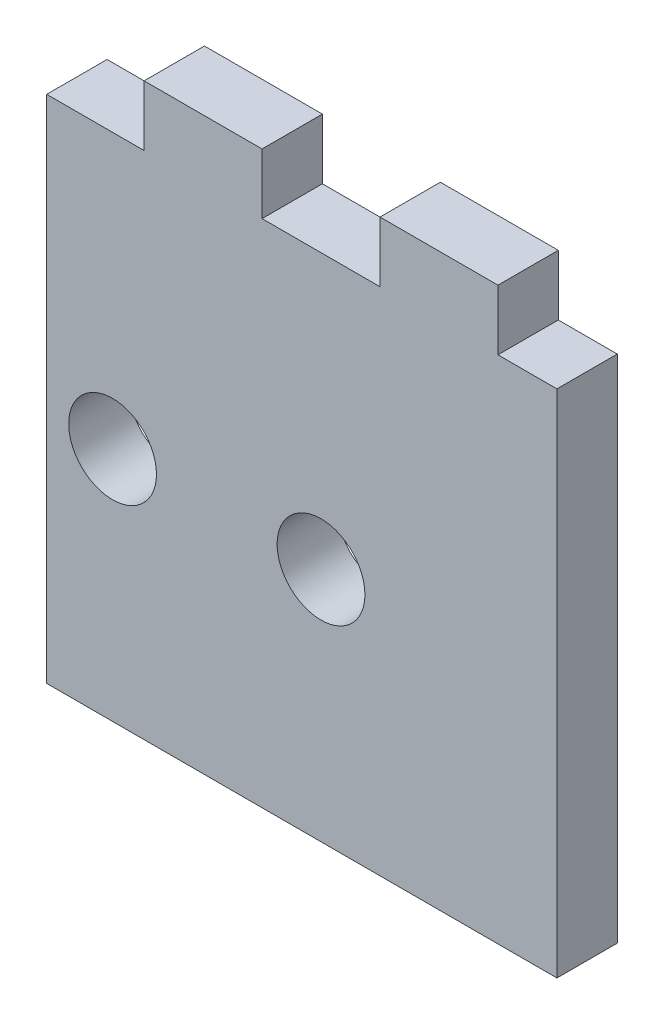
ISO-10303-21;
HEADER;
FILE_DESCRIPTION(('STEP AP214'),'2;1');
FILE_NAME('part.step','',(''),(''),'','','');
FILE_SCHEMA(('AUTOMOTIVE_DESIGN { 1 0 10303 214 1 1 1 1 }'));
ENDSEC;
DATA;
#1=APPLICATION_CONTEXT('core data for automotive mechanical design processes');
#2=APPLICATION_PROTOCOL_DEFINITION('international standard','automotive_design',2000,#1);
#3=PRODUCT_CONTEXT('',#1,'mechanical');
#4=PRODUCT('Part','Part','',(#3));
#5=PRODUCT_RELATED_PRODUCT_CATEGORY('part','',(#4));
#6=PRODUCT_DEFINITION_FORMATION('','',#4);
#7=PRODUCT_DEFINITION_CONTEXT('part definition',#1,'design');
#8=PRODUCT_DEFINITION('design','',#6,#7);
#9=PRODUCT_DEFINITION_SHAPE('','',#8);
#10=(LENGTH_UNIT() NAMED_UNIT(*) SI_UNIT(.MILLI.,.METRE.));
#11=(NAMED_UNIT(*) PLANE_ANGLE_UNIT() SI_UNIT($,.RADIAN.));
#12=(NAMED_UNIT(*) SI_UNIT($,.STERADIAN.) SOLID_ANGLE_UNIT());
#13=UNCERTAINTY_MEASURE_WITH_UNIT(LENGTH_MEASURE(1.E-05),#10,'distance_accuracy_value','');
#14=(GEOMETRIC_REPRESENTATION_CONTEXT(3) GLOBAL_UNCERTAINTY_ASSIGNED_CONTEXT((#13)) GLOBAL_UNIT_ASSIGNED_CONTEXT((#10,
#11,#12)) REPRESENTATION_CONTEXT('',''));
#15=CARTESIAN_POINT('',(0.,0.,0.));
#16=DIRECTION('',(0.,0.,1.));
#17=DIRECTION('',(1.,0.,0.));
#18=AXIS2_PLACEMENT_3D('',#15,#16,#17);
#19=CARTESIAN_POINT('',(0.,0.,5.5));
#20=DIRECTION('',(0.,0.,1.));
#21=DIRECTION('',(1.,0.,0.));
#22=AXIS2_PLACEMENT_3D('',#19,#20,#21);
#23=PLANE('',#22);
#24=CARTESIAN_POINT('',(-21.5,21.5,5.5));
#25=DIRECTION('',(0.,0.,1.));
#26=DIRECTION('',(1.,0.,0.));
#27=AXIS2_PLACEMENT_3D('',#24,#25,#26);
#28=CIRCLE('',#27,4.);
#29=CARTESIAN_POINT('',(-17.5,21.5,5.5));
#30=VERTEX_POINT('',#29);
#31=EDGE_CURVE('E171',#30,#30,#28,.T.);
#32=ORIENTED_EDGE('',*,*,#31,.F.);
#33=EDGE_LOOP('',(#32));
#34=FACE_BOUND('',#33,.T.);
#35=DIRECTION('',(0.,1.,0.));
#36=VECTOR('',#35,1.);
#37=CARTESIAN_POINT('',(0.,46.5,5.5));
#38=LINE('',#37,#36);
#39=CARTESIAN_POINT('',(0.,0.,5.5));
#40=VERTEX_POINT('',#39);
#41=CARTESIAN_POINT('',(0.,46.5,5.5));
#42=VERTEX_POINT('',#41);
#43=EDGE_CURVE('E202',#40,#42,#38,.T.);
#44=ORIENTED_EDGE('',*,*,#43,.T.);
#45=DIRECTION('',(-1.,0.,0.));
#46=VECTOR('',#45,1.);
#47=CARTESIAN_POINT('',(-5.375,46.5,5.5));
#48=LINE('',#47,#46);
#49=CARTESIAN_POINT('',(-5.375,46.5,5.5));
#50=VERTEX_POINT('',#49);
#51=EDGE_CURVE('E110',#42,#50,#48,.T.);
#52=ORIENTED_EDGE('',*,*,#51,.T.);
#53=DIRECTION('',(0.,1.,0.));
#54=VECTOR('',#53,1.);
#55=CARTESIAN_POINT('',(-5.37499999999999,52.,5.5));
#56=LINE('',#55,#54);
#57=CARTESIAN_POINT('',(-5.37499999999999,52.,5.5));
#58=VERTEX_POINT('',#57);
#59=EDGE_CURVE('E239',#50,#58,#56,.T.);
#60=ORIENTED_EDGE('',*,*,#59,.T.);
#61=DIRECTION('',(-1.,0.,0.));
#62=VECTOR('',#61,1.);
#63=CARTESIAN_POINT('',(-16.125,52.,5.5));
#64=LINE('',#63,#62);
#65=CARTESIAN_POINT('',(-16.125,52.,5.5));
#66=VERTEX_POINT('',#65);
#67=EDGE_CURVE('E257',#58,#66,#64,.T.);
#68=ORIENTED_EDGE('',*,*,#67,.T.);
#69=DIRECTION('',(0.,-1.,0.));
#70=VECTOR('',#69,1.);
#71=CARTESIAN_POINT('',(-16.125,46.5,5.5));
#72=LINE('',#71,#70);
#73=CARTESIAN_POINT('',(-16.125,46.5,5.5));
#74=VERTEX_POINT('',#73);
#75=EDGE_CURVE('E253',#66,#74,#72,.T.);
#76=ORIENTED_EDGE('',*,*,#75,.T.);
#77=DIRECTION('',(-1.,0.,0.));
#78=VECTOR('',#77,1.);
#79=CARTESIAN_POINT('',(-16.125,46.5,5.5));
#80=LINE('',#79,#78);
#81=CARTESIAN_POINT('',(-26.875,46.5,5.5));
#82=VERTEX_POINT('',#81);
#83=EDGE_CURVE('E256',#74,#82,#80,.T.);
#84=ORIENTED_EDGE('',*,*,#83,.T.);
#85=DIRECTION('',(0.,1.,0.));
#86=VECTOR('',#85,1.);
#87=CARTESIAN_POINT('',(-26.875,46.5,5.5));
#88=LINE('',#87,#86);
#89=CARTESIAN_POINT('',(-26.875,52.,5.5));
#90=VERTEX_POINT('',#89);
#91=EDGE_CURVE('E261',#82,#90,#88,.T.);
#92=ORIENTED_EDGE('',*,*,#91,.T.);
#93=DIRECTION('',(-1.,0.,0.));
#94=VECTOR('',#93,1.);
#95=CARTESIAN_POINT('',(-26.875,52.,5.5));
#96=LINE('',#95,#94);
#97=CARTESIAN_POINT('',(-37.625,52.,5.5));
#98=VERTEX_POINT('',#97);
#99=EDGE_CURVE('E268',#90,#98,#96,.T.);
#100=ORIENTED_EDGE('',*,*,#99,.T.);
#101=DIRECTION('',(0.,-1.,0.));
#102=VECTOR('',#101,1.);
#103=CARTESIAN_POINT('',(-37.625,52.,5.5));
#104=LINE('',#103,#102);
#105=CARTESIAN_POINT('',(-37.625,46.5,5.5));
#106=VERTEX_POINT('',#105);
#107=EDGE_CURVE('E142',#98,#106,#104,.T.);
#108=ORIENTED_EDGE('',*,*,#107,.T.);
#109=DIRECTION('',(-1.,0.,0.));
#110=VECTOR('',#109,1.);
#111=CARTESIAN_POINT('',(-37.625,46.5,5.5));
#112=LINE('',#111,#110);
#113=CARTESIAN_POINT('',(-46.5,46.5,5.5));
#114=VERTEX_POINT('',#113);
#115=EDGE_CURVE('E135',#106,#114,#112,.T.);
#116=ORIENTED_EDGE('',*,*,#115,.T.);
#117=DIRECTION('',(0.,-1.,0.));
#118=VECTOR('',#117,1.);
#119=CARTESIAN_POINT('',(-46.5,46.5,5.5));
#120=LINE('',#119,#118);
#121=CARTESIAN_POINT('',(-46.5,0.,5.5));
#122=VERTEX_POINT('',#121);
#123=EDGE_CURVE('E139',#114,#122,#120,.T.);
#124=ORIENTED_EDGE('',*,*,#123,.T.);
#125=DIRECTION('',(1.,0.,0.));
#126=VECTOR('',#125,1.);
#127=CARTESIAN_POINT('',(-46.5,0.,5.5));
#128=LINE('',#127,#126);
#129=EDGE_CURVE('E57',#122,#40,#128,.T.);
#130=ORIENTED_EDGE('',*,*,#129,.T.);
#131=EDGE_LOOP('',(#44,#52,#60,#68,#76,#84,#92,#100,#108,#116,#124,#130));
#132=FACE_BOUND('',#131,.T.);
#133=CARTESIAN_POINT('',(-40.5,21.5,5.5));
#134=DIRECTION('',(0.,0.,1.));
#135=DIRECTION('',(1.,0.,0.));
#136=AXIS2_PLACEMENT_3D('',#133,#134,#135);
#137=CIRCLE('',#136,4.);
#138=CARTESIAN_POINT('',(-36.5,21.5,5.5));
#139=VERTEX_POINT('',#138);
#140=EDGE_CURVE('E295',#139,#139,#137,.T.);
#141=ORIENTED_EDGE('',*,*,#140,.F.);
#142=EDGE_LOOP('',(#141));
#143=FACE_BOUND('',#142,.T.);
#144=ADVANCED_FACE('F39',(#34,#132,#143),#23,.T.);
#145=CARTESIAN_POINT('',(0.,0.,0.));
#146=DIRECTION('',(0.,0.,1.));
#147=DIRECTION('',(1.,0.,0.));
#148=AXIS2_PLACEMENT_3D('',#145,#146,#147);
#149=PLANE('',#148);
#150=DIRECTION('',(0.,1.,0.));
#151=VECTOR('',#150,1.);
#152=CARTESIAN_POINT('',(0.,46.5,0.));
#153=LINE('',#152,#151);
#154=CARTESIAN_POINT('',(0.,0.,0.));
#155=VERTEX_POINT('',#154);
#156=CARTESIAN_POINT('',(0.,46.5,0.));
#157=VERTEX_POINT('',#156);
#158=EDGE_CURVE('E166',#155,#157,#153,.T.);
#159=ORIENTED_EDGE('',*,*,#158,.F.);
#160=DIRECTION('',(1.,0.,0.));
#161=VECTOR('',#160,1.);
#162=CARTESIAN_POINT('',(-43.,0.,0.));
#163=LINE('',#162,#161);
#164=CARTESIAN_POINT('',(-46.5,0.,0.));
#165=VERTEX_POINT('',#164);
#166=EDGE_CURVE('E98',#165,#155,#163,.T.);
#167=ORIENTED_EDGE('',*,*,#166,.F.);
#168=DIRECTION('',(0.,-1.,0.));
#169=VECTOR('',#168,1.);
#170=CARTESIAN_POINT('',(-46.5,46.5,0.));
#171=LINE('',#170,#169);
#172=CARTESIAN_POINT('',(-46.5,46.5,0.));
#173=VERTEX_POINT('',#172);
#174=EDGE_CURVE('E197',#173,#165,#171,.T.);
#175=ORIENTED_EDGE('',*,*,#174,.F.);
#176=DIRECTION('',(-1.,0.,0.));
#177=VECTOR('',#176,1.);
#178=CARTESIAN_POINT('',(-37.625,46.5,0.));
#179=LINE('',#178,#177);
#180=CARTESIAN_POINT('',(-37.625,46.5,0.));
#181=VERTEX_POINT('',#180);
#182=EDGE_CURVE('E152',#181,#173,#179,.T.);
#183=ORIENTED_EDGE('',*,*,#182,.F.);
#184=DIRECTION('',(0.,-1.,0.));
#185=VECTOR('',#184,1.);
#186=CARTESIAN_POINT('',(-37.625,52.,0.));
#187=LINE('',#186,#185);
#188=CARTESIAN_POINT('',(-37.625,52.,0.));
#189=VERTEX_POINT('',#188);
#190=EDGE_CURVE('E192',#189,#181,#187,.T.);
#191=ORIENTED_EDGE('',*,*,#190,.F.);
#192=DIRECTION('',(-1.,0.,0.));
#193=VECTOR('',#192,1.);
#194=CARTESIAN_POINT('',(-26.875,52.,0.));
#195=LINE('',#194,#193);
#196=CARTESIAN_POINT('',(-26.875,52.,0.));
#197=VERTEX_POINT('',#196);
#198=EDGE_CURVE('E189',#197,#189,#195,.T.);
#199=ORIENTED_EDGE('',*,*,#198,.F.);
#200=DIRECTION('',(0.,1.,0.));
#201=VECTOR('',#200,1.);
#202=CARTESIAN_POINT('',(-26.875,46.5,0.));
#203=LINE('',#202,#201);
#204=CARTESIAN_POINT('',(-26.875,46.5,0.));
#205=VERTEX_POINT('',#204);
#206=EDGE_CURVE('E186',#205,#197,#203,.T.);
#207=ORIENTED_EDGE('',*,*,#206,.F.);
#208=DIRECTION('',(-1.,0.,0.));
#209=VECTOR('',#208,1.);
#210=CARTESIAN_POINT('',(-16.125,46.5,0.));
#211=LINE('',#210,#209);
#212=CARTESIAN_POINT('',(-16.125,46.5,0.));
#213=VERTEX_POINT('',#212);
#214=EDGE_CURVE('E183',#213,#205,#211,.T.);
#215=ORIENTED_EDGE('',*,*,#214,.F.);
#216=DIRECTION('',(0.,-1.,0.));
#217=VECTOR('',#216,1.);
#218=CARTESIAN_POINT('',(-16.125,46.5,0.));
#219=LINE('',#218,#217);
#220=CARTESIAN_POINT('',(-16.125,52.,0.));
#221=VERTEX_POINT('',#220);
#222=EDGE_CURVE('E180',#221,#213,#219,.T.);
#223=ORIENTED_EDGE('',*,*,#222,.F.);
#224=DIRECTION('',(-1.,0.,0.));
#225=VECTOR('',#224,1.);
#226=CARTESIAN_POINT('',(-16.125,52.,0.));
#227=LINE('',#226,#225);
#228=CARTESIAN_POINT('',(-5.37499999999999,52.,0.));
#229=VERTEX_POINT('',#228);
#230=EDGE_CURVE('E177',#229,#221,#227,.T.);
#231=ORIENTED_EDGE('',*,*,#230,.F.);
#232=DIRECTION('',(0.,1.,0.));
#233=VECTOR('',#232,1.);
#234=CARTESIAN_POINT('',(-5.37499999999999,52.,0.));
#235=LINE('',#234,#233);
#236=CARTESIAN_POINT('',(-5.375,46.5,0.));
#237=VERTEX_POINT('',#236);
#238=EDGE_CURVE('E174',#237,#229,#235,.T.);
#239=ORIENTED_EDGE('',*,*,#238,.F.);
#240=DIRECTION('',(-1.,0.,0.));
#241=VECTOR('',#240,1.);
#242=CARTESIAN_POINT('',(-5.375,46.5,0.));
#243=LINE('',#242,#241);
#244=EDGE_CURVE('E170',#157,#237,#243,.T.);
#245=ORIENTED_EDGE('',*,*,#244,.F.);
#246=EDGE_LOOP('',(#159,#167,#175,#183,#191,#199,#207,#215,#223,#231,#239,#245));
#247=FACE_BOUND('',#246,.T.);
#248=CARTESIAN_POINT('',(-21.5,21.5,0.));
#249=DIRECTION('',(0.,0.,1.));
#250=DIRECTION('',(1.,0.,0.));
#251=AXIS2_PLACEMENT_3D('',#248,#249,#250);
#252=CIRCLE('',#251,4.);
#253=CARTESIAN_POINT('',(-17.5,21.5,0.));
#254=VERTEX_POINT('',#253);
#255=EDGE_CURVE('E290',#254,#254,#252,.T.);
#256=ORIENTED_EDGE('',*,*,#255,.T.);
#257=EDGE_LOOP('',(#256));
#258=FACE_BOUND('',#257,.T.);
#259=CARTESIAN_POINT('',(-40.5,21.5,0.));
#260=DIRECTION('',(0.,0.,1.));
#261=DIRECTION('',(1.,0.,0.));
#262=AXIS2_PLACEMENT_3D('',#259,#260,#261);
#263=CIRCLE('',#262,4.);
#264=CARTESIAN_POINT('',(-36.5,21.5,0.));
#265=VERTEX_POINT('',#264);
#266=EDGE_CURVE('E299',#265,#265,#263,.T.);
#267=ORIENTED_EDGE('',*,*,#266,.T.);
#268=EDGE_LOOP('',(#267));
#269=FACE_BOUND('',#268,.T.);
#270=ADVANCED_FACE('F241',(#247,#258,#269),#149,.F.);
#271=CARTESIAN_POINT('',(0.,46.5,5.5));
#272=DIRECTION('',(-1.,0.,0.));
#273=DIRECTION('',(0.,0.,1.));
#274=AXIS2_PLACEMENT_3D('',#271,#272,#273);
#275=PLANE('',#274);
#276=ORIENTED_EDGE('',*,*,#158,.T.);
#277=DIRECTION('',(0.,0.,-1.));
#278=VECTOR('',#277,1.);
#279=CARTESIAN_POINT('',(0.,46.5,5.5));
#280=LINE('',#279,#278);
#281=EDGE_CURVE('E11',#42,#157,#280,.T.);
#282=ORIENTED_EDGE('',*,*,#281,.F.);
#283=ORIENTED_EDGE('',*,*,#43,.F.);
#284=DIRECTION('',(0.,0.,-1.));
#285=VECTOR('',#284,1.);
#286=CARTESIAN_POINT('',(0.,0.,5.5));
#287=LINE('',#286,#285);
#288=EDGE_CURVE('E162',#40,#155,#287,.T.);
#289=ORIENTED_EDGE('',*,*,#288,.T.);
#290=EDGE_LOOP('',(#276,#282,#283,#289));
#291=FACE_BOUND('',#290,.T.);
#292=ADVANCED_FACE('F41',(#291),#275,.F.);
#293=CARTESIAN_POINT('',(-5.375,46.5,5.5));
#294=DIRECTION('',(0.,-1.,0.));
#295=DIRECTION('',(0.,0.,-1.));
#296=AXIS2_PLACEMENT_3D('',#293,#294,#295);
#297=PLANE('',#296);
#298=ORIENTED_EDGE('',*,*,#244,.T.);
#299=DIRECTION('',(0.,0.,-1.));
#300=VECTOR('',#299,1.);
#301=CARTESIAN_POINT('',(-5.375,46.5,5.5));
#302=LINE('',#301,#300);
#303=EDGE_CURVE('E49',#50,#237,#302,.T.);
#304=ORIENTED_EDGE('',*,*,#303,.F.);
#305=ORIENTED_EDGE('',*,*,#51,.F.);
#306=ORIENTED_EDGE('',*,*,#281,.T.);
#307=EDGE_LOOP('',(#298,#304,#305,#306));
#308=FACE_BOUND('',#307,.T.);
#309=ADVANCED_FACE('F344',(#308),#297,.F.);
#310=CARTESIAN_POINT('',(-5.37499999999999,52.,5.5));
#311=DIRECTION('',(-1.,0.,0.));
#312=DIRECTION('',(0.,-1.,0.));
#313=AXIS2_PLACEMENT_3D('',#310,#311,#312);
#314=PLANE('',#313);
#315=ORIENTED_EDGE('',*,*,#238,.T.);
#316=DIRECTION('',(0.,0.,-1.));
#317=VECTOR('',#316,1.);
#318=CARTESIAN_POINT('',(-5.37499999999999,52.,5.5));
#319=LINE('',#318,#317);
#320=EDGE_CURVE('E229',#58,#229,#319,.T.);
#321=ORIENTED_EDGE('',*,*,#320,.F.);
#322=ORIENTED_EDGE('',*,*,#59,.F.);
#323=ORIENTED_EDGE('',*,*,#303,.T.);
#324=EDGE_LOOP('',(#315,#321,#322,#323));
#325=FACE_BOUND('',#324,.T.);
#326=ADVANCED_FACE('F237',(#325),#314,.F.);
#327=CARTESIAN_POINT('',(-16.125,52.,5.5));
#328=DIRECTION('',(0.,-1.,0.));
#329=DIRECTION('',(0.,0.,-1.));
#330=AXIS2_PLACEMENT_3D('',#327,#328,#329);
#331=PLANE('',#330);
#332=ORIENTED_EDGE('',*,*,#230,.T.);
#333=DIRECTION('',(0.,0.,-1.));
#334=VECTOR('',#333,1.);
#335=CARTESIAN_POINT('',(-16.125,52.,5.5));
#336=LINE('',#335,#334);
#337=EDGE_CURVE('E225',#66,#221,#336,.T.);
#338=ORIENTED_EDGE('',*,*,#337,.F.);
#339=ORIENTED_EDGE('',*,*,#67,.F.);
#340=ORIENTED_EDGE('',*,*,#320,.T.);
#341=EDGE_LOOP('',(#332,#338,#339,#340));
#342=FACE_BOUND('',#341,.T.);
#343=ADVANCED_FACE('F247',(#342),#331,.F.);
#344=CARTESIAN_POINT('',(-16.125,46.5,5.5));
#345=DIRECTION('',(1.,0.,0.));
#346=DIRECTION('',(0.,0.,-1.));
#347=AXIS2_PLACEMENT_3D('',#344,#345,#346);
#348=PLANE('',#347);
#349=ORIENTED_EDGE('',*,*,#222,.T.);
#350=DIRECTION('',(0.,0.,-1.));
#351=VECTOR('',#350,1.);
#352=CARTESIAN_POINT('',(-16.125,46.5,5.5));
#353=LINE('',#352,#351);
#354=EDGE_CURVE('E221',#74,#213,#353,.T.);
#355=ORIENTED_EDGE('',*,*,#354,.F.);
#356=ORIENTED_EDGE('',*,*,#75,.F.);
#357=ORIENTED_EDGE('',*,*,#337,.T.);
#358=EDGE_LOOP('',(#349,#355,#356,#357));
#359=FACE_BOUND('',#358,.T.);
#360=ADVANCED_FACE('F251',(#359),#348,.F.);
#361=CARTESIAN_POINT('',(-16.125,46.5,5.5));
#362=DIRECTION('',(0.,-1.,0.));
#363=DIRECTION('',(0.,0.,-1.));
#364=AXIS2_PLACEMENT_3D('',#361,#362,#363);
#365=PLANE('',#364);
#366=ORIENTED_EDGE('',*,*,#214,.T.);
#367=DIRECTION('',(0.,0.,-1.));
#368=VECTOR('',#367,1.);
#369=CARTESIAN_POINT('',(-26.875,46.5,5.5));
#370=LINE('',#369,#368);
#371=EDGE_CURVE('E217',#82,#205,#370,.T.);
#372=ORIENTED_EDGE('',*,*,#371,.F.);
#373=ORIENTED_EDGE('',*,*,#83,.F.);
#374=ORIENTED_EDGE('',*,*,#354,.T.);
#375=EDGE_LOOP('',(#366,#372,#373,#374));
#376=FACE_BOUND('',#375,.T.);
#377=ADVANCED_FACE('F334',(#376),#365,.F.);
#378=CARTESIAN_POINT('',(-26.875,46.5,5.5));
#379=DIRECTION('',(-1.,0.,0.));
#380=DIRECTION('',(0.,0.,1.));
#381=AXIS2_PLACEMENT_3D('',#378,#379,#380);
#382=PLANE('',#381);
#383=ORIENTED_EDGE('',*,*,#206,.T.);
#384=DIRECTION('',(0.,0.,-1.));
#385=VECTOR('',#384,1.);
#386=CARTESIAN_POINT('',(-26.875,52.,5.5));
#387=LINE('',#386,#385);
#388=EDGE_CURVE('E213',#90,#197,#387,.T.);
#389=ORIENTED_EDGE('',*,*,#388,.F.);
#390=ORIENTED_EDGE('',*,*,#91,.F.);
#391=ORIENTED_EDGE('',*,*,#371,.T.);
#392=EDGE_LOOP('',(#383,#389,#390,#391));
#393=FACE_BOUND('',#392,.T.);
#394=ADVANCED_FACE('F331',(#393),#382,.F.);
#395=CARTESIAN_POINT('',(-26.875,52.,5.5));
#396=DIRECTION('',(0.,-1.,0.));
#397=DIRECTION('',(0.,0.,-1.));
#398=AXIS2_PLACEMENT_3D('',#395,#396,#397);
#399=PLANE('',#398);
#400=ORIENTED_EDGE('',*,*,#198,.T.);
#401=DIRECTION('',(0.,0.,-1.));
#402=VECTOR('',#401,1.);
#403=CARTESIAN_POINT('',(-37.625,52.,5.5));
#404=LINE('',#403,#402);
#405=EDGE_CURVE('E209',#98,#189,#404,.T.);
#406=ORIENTED_EDGE('',*,*,#405,.F.);
#407=ORIENTED_EDGE('',*,*,#99,.F.);
#408=ORIENTED_EDGE('',*,*,#388,.T.);
#409=EDGE_LOOP('',(#400,#406,#407,#408));
#410=FACE_BOUND('',#409,.T.);
#411=ADVANCED_FACE('F276',(#410),#399,.F.);
#412=CARTESIAN_POINT('',(-37.625,52.,5.5));
#413=DIRECTION('',(1.,0.,0.));
#414=DIRECTION('',(0.,0.,-1.));
#415=AXIS2_PLACEMENT_3D('',#412,#413,#414);
#416=PLANE('',#415);
#417=ORIENTED_EDGE('',*,*,#190,.T.);
#418=DIRECTION('',(0.,0.,-1.));
#419=VECTOR('',#418,1.);
#420=CARTESIAN_POINT('',(-37.625,46.5,5.5));
#421=LINE('',#420,#419);
#422=EDGE_CURVE('E155',#106,#181,#421,.T.);
#423=ORIENTED_EDGE('',*,*,#422,.F.);
#424=ORIENTED_EDGE('',*,*,#107,.F.);
#425=ORIENTED_EDGE('',*,*,#405,.T.);
#426=EDGE_LOOP('',(#417,#423,#424,#425));
#427=FACE_BOUND('',#426,.T.);
#428=ADVANCED_FACE('F280',(#427),#416,.F.);
#429=CARTESIAN_POINT('',(-37.625,46.5,5.5));
#430=DIRECTION('',(0.,-1.,0.));
#431=DIRECTION('',(0.,0.,-1.));
#432=AXIS2_PLACEMENT_3D('',#429,#430,#431);
#433=PLANE('',#432);
#434=ORIENTED_EDGE('',*,*,#182,.T.);
#435=DIRECTION('',(0.,0.,-1.));
#436=VECTOR('',#435,1.);
#437=CARTESIAN_POINT('',(-46.5,46.5,5.5));
#438=LINE('',#437,#436);
#439=EDGE_CURVE('E149',#114,#173,#438,.T.);
#440=ORIENTED_EDGE('',*,*,#439,.F.);
#441=ORIENTED_EDGE('',*,*,#115,.F.);
#442=ORIENTED_EDGE('',*,*,#422,.T.);
#443=EDGE_LOOP('',(#434,#440,#441,#442));
#444=FACE_BOUND('',#443,.T.);
#445=ADVANCED_FACE('F150',(#444),#433,.F.);
#446=CARTESIAN_POINT('',(-46.5,46.5,5.5));
#447=DIRECTION('',(1.,0.,0.));
#448=DIRECTION('',(0.,1.,0.));
#449=AXIS2_PLACEMENT_3D('',#446,#447,#448);
#450=PLANE('',#449);
#451=ORIENTED_EDGE('',*,*,#174,.T.);
#452=DIRECTION('',(0.,0.,-1.));
#453=VECTOR('',#452,1.);
#454=CARTESIAN_POINT('',(-46.5,0.,5.5));
#455=LINE('',#454,#453);
#456=EDGE_CURVE('E156',#122,#165,#455,.T.);
#457=ORIENTED_EDGE('',*,*,#456,.F.);
#458=ORIENTED_EDGE('',*,*,#123,.F.);
#459=ORIENTED_EDGE('',*,*,#439,.T.);
#460=EDGE_LOOP('',(#451,#457,#458,#459));
#461=FACE_BOUND('',#460,.T.);
#462=ADVANCED_FACE('F158',(#461),#450,.F.);
#463=CARTESIAN_POINT('',(-43.,0.,5.5));
#464=DIRECTION('',(0.,1.,0.));
#465=DIRECTION('',(-1.,0.,0.));
#466=AXIS2_PLACEMENT_3D('',#463,#464,#465);
#467=PLANE('',#466);
#468=ORIENTED_EDGE('',*,*,#166,.T.);
#469=ORIENTED_EDGE('',*,*,#288,.F.);
#470=ORIENTED_EDGE('',*,*,#129,.F.);
#471=ORIENTED_EDGE('',*,*,#456,.T.);
#472=EDGE_LOOP('',(#468,#469,#470,#471));
#473=FACE_BOUND('',#472,.T.);
#474=ADVANCED_FACE('F281',(#473),#467,.F.);
#475=CARTESIAN_POINT('',(-21.5,21.5,5.5));
#476=DIRECTION('',(0.,0.,-1.));
#477=DIRECTION('',(-1.,0.,0.));
#478=AXIS2_PLACEMENT_3D('',#475,#476,#477);
#479=CYLINDRICAL_SURFACE('',#478,4.);
#480=ORIENTED_EDGE('',*,*,#31,.T.);
#481=EDGE_LOOP('',(#480));
#482=FACE_BOUND('',#481,.T.);
#483=ORIENTED_EDGE('',*,*,#255,.F.);
#484=EDGE_LOOP('',(#483));
#485=FACE_BOUND('',#484,.T.);
#486=ADVANCED_FACE('F318',(#482,#485),#479,.F.);
#487=CARTESIAN_POINT('',(-40.5,21.5,5.5));
#488=DIRECTION('',(0.,0.,-1.));
#489=DIRECTION('',(-1.,0.,0.));
#490=AXIS2_PLACEMENT_3D('',#487,#488,#489);
#491=CYLINDRICAL_SURFACE('',#490,4.);
#492=ORIENTED_EDGE('',*,*,#140,.T.);
#493=EDGE_LOOP('',(#492));
#494=FACE_BOUND('',#493,.T.);
#495=ORIENTED_EDGE('',*,*,#266,.F.);
#496=EDGE_LOOP('',(#495));
#497=FACE_BOUND('',#496,.T.);
#498=ADVANCED_FACE('F307',(#494,#497),#491,.F.);
#499=CLOSED_SHELL('',(#144,#270,#292,#309,#326,#343,#360,#377,#394,#411,#428,#445,#462,#474,
#486,#498));
#500=MANIFOLD_SOLID_BREP('B2',#499);
#501=ADVANCED_BREP_SHAPE_REPRESENTATION('',(#18,#500),#14);
#502=SHAPE_DEFINITION_REPRESENTATION(#9,#501);
ENDSEC;
END-ISO-10303-21;
